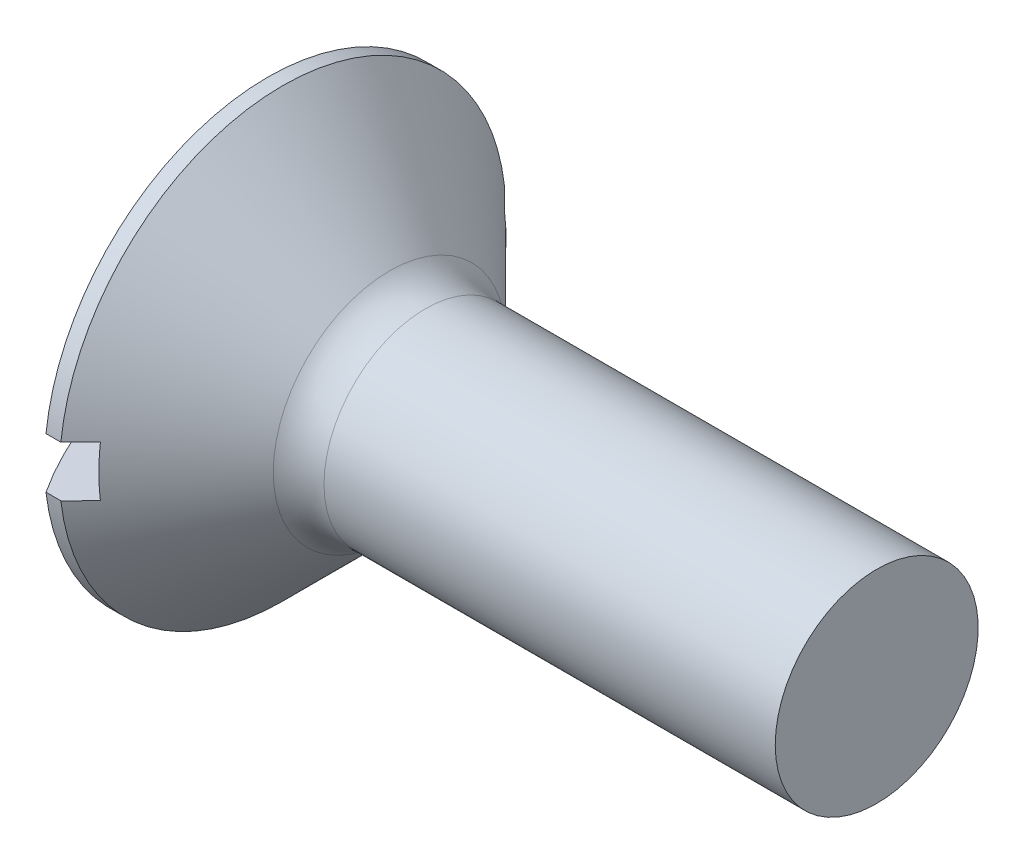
ISO-10303-21;
HEADER;
FILE_DESCRIPTION(('STEP AP214'),'2;1');
FILE_NAME('part.step','',(''),(''),'','','');
FILE_SCHEMA(('AUTOMOTIVE_DESIGN { 1 0 10303 214 1 1 1 1 }'));
ENDSEC;
DATA;
#1=APPLICATION_CONTEXT('core data for automotive mechanical design processes');
#2=APPLICATION_PROTOCOL_DEFINITION('international standard','automotive_design',2000,#1);
#3=PRODUCT_CONTEXT('',#1,'mechanical');
#4=PRODUCT('Part','Part','',(#3));
#5=PRODUCT_RELATED_PRODUCT_CATEGORY('part','',(#4));
#6=PRODUCT_DEFINITION_FORMATION('','',#4);
#7=PRODUCT_DEFINITION_CONTEXT('part definition',#1,'design');
#8=PRODUCT_DEFINITION('design','',#6,#7);
#9=PRODUCT_DEFINITION_SHAPE('','',#8);
#10=(LENGTH_UNIT() NAMED_UNIT(*) SI_UNIT(.MILLI.,.METRE.));
#11=(NAMED_UNIT(*) PLANE_ANGLE_UNIT() SI_UNIT($,.RADIAN.));
#12=(NAMED_UNIT(*) SI_UNIT($,.STERADIAN.) SOLID_ANGLE_UNIT());
#13=UNCERTAINTY_MEASURE_WITH_UNIT(LENGTH_MEASURE(1.E-05),#10,'distance_accuracy_value','');
#14=(GEOMETRIC_REPRESENTATION_CONTEXT(3) GLOBAL_UNCERTAINTY_ASSIGNED_CONTEXT((#13)) GLOBAL_UNIT_ASSIGNED_CONTEXT((#10,
#11,#12)) REPRESENTATION_CONTEXT('',''));
#15=CARTESIAN_POINT('',(0.,0.,0.));
#16=DIRECTION('',(0.,0.,1.));
#17=DIRECTION('',(1.,0.,0.));
#18=AXIS2_PLACEMENT_3D('',#15,#16,#17);
#19=CARTESIAN_POINT('',(-1.34990698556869,0.,0.));
#20=DIRECTION('',(-1.,0.,0.));
#21=DIRECTION('',(0.,0.,1.));
#22=AXIS2_PLACEMENT_3D('',#19,#20,#21);
#23=CYLINDRICAL_SURFACE('',#22,2.2);
#24=CARTESIAN_POINT('',(0.805787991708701,0.,0.));
#25=DIRECTION('',(-1.,0.,0.));
#26=DIRECTION('',(0.,0.,1.));
#27=AXIS2_PLACEMENT_3D('',#24,#25,#26);
#28=CIRCLE('',#27,2.2);
#29=CARTESIAN_POINT('',(0.805787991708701,-0.25,-2.18574929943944));
#30=VERTEX_POINT('',#29);
#31=CARTESIAN_POINT('',(0.805787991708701,-0.25,2.18574929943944));
#32=VERTEX_POINT('',#31);
#33=EDGE_CURVE('E113',#30,#32,#28,.T.);
#34=ORIENTED_EDGE('',*,*,#33,.T.);
#35=DIRECTION('',(-1.,0.,0.));
#36=VECTOR('',#35,1.);
#37=CARTESIAN_POINT('',(-1.34990698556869,-0.25,2.18574929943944));
#38=LINE('',#37,#36);
#39=CARTESIAN_POINT('',(0.659341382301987,-0.25,2.18574929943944));
#40=VERTEX_POINT('',#39);
#41=EDGE_CURVE('E118',#32,#40,#38,.T.);
#42=ORIENTED_EDGE('',*,*,#41,.T.);
#43=CARTESIAN_POINT('',(0.659341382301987,0.,0.));
#44=DIRECTION('',(-1.,0.,0.));
#45=DIRECTION('',(0.,0.,1.));
#46=AXIS2_PLACEMENT_3D('',#43,#44,#45);
#47=CIRCLE('',#46,2.2);
#48=CARTESIAN_POINT('',(0.659341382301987,-0.25,-2.18574929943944));
#49=VERTEX_POINT('',#48);
#50=EDGE_CURVE('E165',#49,#40,#47,.T.);
#51=ORIENTED_EDGE('',*,*,#50,.F.);
#52=DIRECTION('',(-1.,0.,0.));
#53=VECTOR('',#52,1.);
#54=CARTESIAN_POINT('',(-1.34990698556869,-0.25,-2.18574929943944));
#55=LINE('',#54,#53);
#56=EDGE_CURVE('E58',#49,#30,#55,.F.);
#57=ORIENTED_EDGE('',*,*,#56,.T.);
#58=EDGE_LOOP('',(#34,#42,#51,#57));
#59=FACE_BOUND('',#58,.T.);
#60=ADVANCED_FACE('F43',(#59),#23,.T.);
#61=CARTESIAN_POINT('',(4.,0.,0.));
#62=DIRECTION('',(-1.,0.,0.));
#63=DIRECTION('',(0.,1.,0.));
#64=AXIS2_PLACEMENT_3D('',#61,#62,#63);
#65=SPHERICAL_SURFACE('',#64,4.);
#66=CARTESIAN_POINT('',(0.659341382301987,0.25,2.18574929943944));
#67=VERTEX_POINT('',#66);
#68=CARTESIAN_POINT('',(0.659341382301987,0.25,-2.18574929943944));
#69=VERTEX_POINT('',#68);
#70=EDGE_CURVE('E161',#67,#69,#47,.T.);
#71=ORIENTED_EDGE('',*,*,#70,.T.);
#72=CARTESIAN_POINT('',(4.,0.25,0.));
#73=DIRECTION('',(0.,1.,0.));
#74=DIRECTION('',(0.,0.,1.));
#75=AXIS2_PLACEMENT_3D('',#72,#73,#74);
#76=CIRCLE('',#75,3.99217985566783);
#77=EDGE_CURVE('E178',#69,#67,#76,.T.);
#78=ORIENTED_EDGE('',*,*,#77,.T.);
#79=EDGE_LOOP('',(#71,#78));
#80=FACE_BOUND('',#79,.T.);
#81=ADVANCED_FACE('F141',(#80),#65,.T.);
#82=CARTESIAN_POINT('',(6.65934138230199,1.,0.));
#83=DIRECTION('',(-1.,0.,0.));
#84=DIRECTION('',(0.,0.,1.));
#85=AXIS2_PLACEMENT_3D('',#82,#83,#84);
#86=PLANE('',#85);
#87=CARTESIAN_POINT('',(6.65934138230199,0.,0.));
#88=DIRECTION('',(-1.,0.,0.));
#89=DIRECTION('',(0.,0.,1.));
#90=AXIS2_PLACEMENT_3D('',#87,#88,#89);
#91=CIRCLE('',#90,1.);
#92=CARTESIAN_POINT('',(6.65934138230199,0.,1.));
#93=VERTEX_POINT('',#92);
#94=EDGE_CURVE('E174',#93,#93,#91,.T.);
#95=ORIENTED_EDGE('',*,*,#94,.F.);
#96=EDGE_LOOP('',(#95));
#97=FACE_BOUND('',#96,.T.);
#98=ADVANCED_FACE('F45',(#97),#86,.F.);
#99=CARTESIAN_POINT('',(-1.34990698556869,0.,0.));
#100=DIRECTION('',(-1.,0.,0.));
#101=DIRECTION('',(0.,0.,1.));
#102=AXIS2_PLACEMENT_3D('',#99,#100,#101);
#103=CYLINDRICAL_SURFACE('',#102,1.);
#104=CARTESIAN_POINT('',(2.21289477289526,0.,0.));
#105=DIRECTION('',(-1.,0.,0.));
#106=DIRECTION('',(0.,0.,1.));
#107=AXIS2_PLACEMENT_3D('',#104,#105,#106);
#108=CIRCLE('',#107,1.);
#109=CARTESIAN_POINT('',(2.21289477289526,0.,1.));
#110=VERTEX_POINT('',#109);
#111=EDGE_CURVE('E171',#110,#110,#108,.T.);
#112=ORIENTED_EDGE('',*,*,#111,.F.);
#113=EDGE_LOOP('',(#112));
#114=FACE_BOUND('',#113,.T.);
#115=ORIENTED_EDGE('',*,*,#94,.T.);
#116=EDGE_LOOP('',(#115));
#117=FACE_BOUND('',#116,.T.);
#118=ADVANCED_FACE('F242',(#114,#117),#103,.T.);
#119=CARTESIAN_POINT('',(2.21289477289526,0.,0.));
#120=DIRECTION('',(-1.,0.,0.));
#121=DIRECTION('',(0.,0.,1.));
#122=AXIS2_PLACEMENT_3D('',#119,#120,#121);
#123=TOROIDAL_SURFACE('',#122,1.5,0.5);
#124=CARTESIAN_POINT('',(1.85934138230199,0.,0.));
#125=DIRECTION('',(-1.,0.,0.));
#126=DIRECTION('',(0.,0.,1.));
#127=AXIS2_PLACEMENT_3D('',#124,#125,#126);
#128=CIRCLE('',#127,1.14644660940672);
#129=CARTESIAN_POINT('',(1.85934138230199,0.,1.14644660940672));
#130=VERTEX_POINT('',#129);
#131=EDGE_CURVE('E163',#130,#130,#128,.T.);
#132=ORIENTED_EDGE('',*,*,#131,.F.);
#133=EDGE_LOOP('',(#132));
#134=FACE_BOUND('',#133,.T.);
#135=ORIENTED_EDGE('',*,*,#111,.T.);
#136=EDGE_LOOP('',(#135));
#137=FACE_BOUND('',#136,.T.);
#138=ADVANCED_FACE('F148',(#134,#137),#123,.F.);
#139=CARTESIAN_POINT('',(1.85934138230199,0.,0.));
#140=DIRECTION('',(-1.,0.,0.));
#141=DIRECTION('',(0.,0.,1.));
#142=AXIS2_PLACEMENT_3D('',#139,#140,#141);
#143=CONICAL_SURFACE('',#142,1.14644660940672,0.785398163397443);
#144=CARTESIAN_POINT('',(1.,0.,0.));
#145=DIRECTION('',(1.,0.,0.));
#146=DIRECTION('',(0.,0.,-1.));
#147=AXIS2_PLACEMENT_3D('',#144,#145,#146);
#148=CIRCLE('',#147,2.0057879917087);
#149=CARTESIAN_POINT('',(1.,-0.25,-1.99014709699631));
#150=VERTEX_POINT('',#149);
#151=CARTESIAN_POINT('',(1.,0.25,-1.99014709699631));
#152=VERTEX_POINT('',#151);
#153=EDGE_CURVE('E11',#150,#152,#148,.T.);
#154=ORIENTED_EDGE('',*,*,#153,.T.);
#155=CARTESIAN_POINT('',(-1.83698245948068,0.25,4.83631322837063));
#156=CARTESIAN_POINT('',(-1.67200251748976,0.25,4.67111124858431));
#157=CARTESIAN_POINT('',(-1.50703219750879,0.25,4.50589965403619));
#158=CARTESIAN_POINT('',(-1.17712189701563,0.25,4.17544365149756));
#159=CARTESIAN_POINT('',(-1.01218191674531,0.25,4.01019924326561));
#160=CARTESIAN_POINT('',(-0.682317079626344,0.25,3.67963765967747));
#161=CARTESIAN_POINT('',(-0.517392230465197,0.25,3.51432047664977));
#162=CARTESIAN_POINT('',(-0.187610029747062,0.25,3.18362124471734));
#163=CARTESIAN_POINT('',(-0.0227526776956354,0.25,3.0182391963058));
#164=CARTESIAN_POINT('',(0.310957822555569,0.25,2.68324954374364));
#165=CARTESIAN_POINT('',(0.479808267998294,0.25,2.51363924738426));
#166=CARTESIAN_POINT('',(0.817318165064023,0.25,2.17422109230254));
#167=CARTESIAN_POINT('',(0.985977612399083,0.25,2.00441322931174));
#168=CARTESIAN_POINT('',(1.23864723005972,0.25,1.74940368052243));
#169=CARTESIAN_POINT('',(1.32281246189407,0.25,1.66435565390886));
#170=CARTESIAN_POINT('',(1.49097971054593,0.25,1.49409670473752));
#171=CARTESIAN_POINT('',(1.574981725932,0.25,1.40888578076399));
#172=CARTESIAN_POINT('',(1.74270521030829,0.25,1.23819529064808));
#173=CARTESIAN_POINT('',(1.82642669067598,0.25,1.15271573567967));
#174=CARTESIAN_POINT('',(1.99336991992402,0.25,0.981270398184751));
#175=CARTESIAN_POINT('',(2.07659167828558,0.25,0.895304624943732));
#176=CARTESIAN_POINT('',(2.18157923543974,0.25,0.785407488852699));
#177=CARTESIAN_POINT('',(2.20387594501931,0.25,0.761984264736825));
#178=CARTESIAN_POINT('',(2.24835297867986,0.25,0.715027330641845));
#179=CARTESIAN_POINT('',(2.27053330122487,0.25,0.691493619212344));
#180=CARTESIAN_POINT('',(2.33674522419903,0.25,0.620804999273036));
#181=CARTESIAN_POINT('',(2.38056068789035,0.25,0.573445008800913));
#182=CARTESIAN_POINT('',(2.45273508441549,0.25,0.493510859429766));
#183=CARTESIAN_POINT('',(2.48141411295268,0.25,0.461225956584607));
#184=CARTESIAN_POINT('',(2.53801077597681,0.25,0.395724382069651));
#185=CARTESIAN_POINT('',(2.56592437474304,0.25,0.362504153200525));
#186=CARTESIAN_POINT('',(2.60656438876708,0.25,0.311422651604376));
#187=CARTESIAN_POINT('',(2.61996632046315,0.25,0.294102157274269));
#188=CARTESIAN_POINT('',(2.6460562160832,0.25,0.258934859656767));
#189=CARTESIAN_POINT('',(2.65874444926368,0.25,0.241088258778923));
#190=CARTESIAN_POINT('',(2.68293598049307,0.25,0.204736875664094));
#191=CARTESIAN_POINT('',(2.69444527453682,0.25,0.186236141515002));
#192=CARTESIAN_POINT('',(2.71558726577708,0.25,0.148210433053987));
#193=CARTESIAN_POINT('',(2.7252251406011,0.25,0.128688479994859));
#194=CARTESIAN_POINT('',(2.7393019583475,0.25,0.0933128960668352));
#195=CARTESIAN_POINT('',(2.74443725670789,0.25,0.0777471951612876));
#196=CARTESIAN_POINT('',(2.75204947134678,0.25,0.0460145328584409));
#197=CARTESIAN_POINT('',(2.75453865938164,0.25,0.029850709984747));
#198=CARTESIAN_POINT('',(2.75630624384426,0.25,-0.00280238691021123));
#199=CARTESIAN_POINT('',(2.75555754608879,0.25,-0.0192932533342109));
#200=CARTESIAN_POINT('',(2.75098042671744,0.25,-0.0518644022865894));
#201=CARTESIAN_POINT('',(2.74714133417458,0.25,-0.06794306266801));
#202=CARTESIAN_POINT('',(2.73445798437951,0.25,-0.107972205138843));
#203=CARTESIAN_POINT('',(2.72402277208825,0.25,-0.131395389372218));
#204=CARTESIAN_POINT('',(2.70620549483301,0.25,-0.165353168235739));
#205=CARTESIAN_POINT('',(2.69988385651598,0.25,-0.176507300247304));
#206=CARTESIAN_POINT('',(2.68669482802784,0.25,-0.198488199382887));
#207=CARTESIAN_POINT('',(2.67982767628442,0.25,-0.209315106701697));
#208=CARTESIAN_POINT('',(2.65584214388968,0.25,-0.245635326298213));
#209=CARTESIAN_POINT('',(2.63779409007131,0.25,-0.270506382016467));
#210=CARTESIAN_POINT('',(2.60051835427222,0.25,-0.319355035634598));
#211=CARTESIAN_POINT('',(2.58128966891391,0.25,-0.343331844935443));
#212=CARTESIAN_POINT('',(2.54209197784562,0.25,-0.390758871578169));
#213=CARTESIAN_POINT('',(2.52212144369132,0.25,-0.414207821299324));
#214=CARTESIAN_POINT('',(2.4817349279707,0.25,-0.460720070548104));
#215=CARTESIAN_POINT('',(2.4613189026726,0.25,-0.483783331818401));
#216=CARTESIAN_POINT('',(2.39956443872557,0.25,-0.552654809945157));
#217=CARTESIAN_POINT('',(2.35778563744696,0.25,-0.598067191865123));
#218=CARTESIAN_POINT('',(2.27369736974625,0.25,-0.688267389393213));
#219=CARTESIAN_POINT('',(2.2313887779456,0.25,-0.733056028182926));
#220=CARTESIAN_POINT('',(2.10469544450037,0.25,-0.866154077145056));
#221=CARTESIAN_POINT('',(2.01981164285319,0.25,-0.953987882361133));
#222=CARTESIAN_POINT('',(1.84949069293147,0.25,-1.12911950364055));
#223=CARTESIAN_POINT('',(1.76405352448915,0.25,-1.21641729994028));
#224=CARTESIAN_POINT('',(1.59282418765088,0.25,-1.39076948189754));
#225=CARTESIAN_POINT('',(1.50703183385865,0.25,-1.47782368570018));
#226=CARTESIAN_POINT('',(1.33527318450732,0.25,-1.651757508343));
#227=CARTESIAN_POINT('',(1.24930689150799,0.25,-1.73863712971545));
#228=CARTESIAN_POINT('',(0.991738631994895,0.25,-1.99861440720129));
#229=CARTESIAN_POINT('',(0.819973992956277,0.25,-2.17155089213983));
#230=CARTESIAN_POINT('',(0.476274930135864,0.25,-2.51719193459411));
#231=CARTESIAN_POINT('',(0.304340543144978,0.25,-2.68989652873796));
#232=CARTESIAN_POINT('',(-0.0314189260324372,0.25,-3.02693427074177));
#233=CARTESIAN_POINT('',(-0.195238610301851,0.25,-3.19127279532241));
#234=CARTESIAN_POINT('',(-0.522952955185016,0.25,-3.51989485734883));
#235=CARTESIAN_POINT('',(-0.686847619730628,0.25,-3.6841783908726));
#236=CARTESIAN_POINT('',(-1.01510328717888,0.25,-4.01312614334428));
#237=CARTESIAN_POINT('',(-1.1794644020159,0.25,-4.17779025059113));
#238=CARTESIAN_POINT('',(-1.50820797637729,0.25,-4.50707716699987));
#239=CARTESIAN_POINT('',(-1.67259043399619,0.25,-4.67169997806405));
#240=CARTESIAN_POINT('',(-1.83698245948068,0.25,-4.83631322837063));
#241=B_SPLINE_CURVE_WITH_KNOTS('',3,(#155,#156,#157,#158,#159,#160,#161,#162,#163,#164,#165,
#166,#167,#168,#169,#170,#171,#172,#173,#174,#175,#176,#177,#178,#179,#180,#181,#182,#183,#184,
#185,#186,#187,#188,#189,#190,#191,#192,#193,#194,#195,#196,#197,#198,#199,#200,#201,#202,#203,
#204,#205,#206,#207,#208,#209,#210,#211,#212,#213,#214,#215,#216,#217,#218,#219,#220,#221,#222,
#223,#224,#225,#226,#227,#228,#229,#230,#231,#232,#233,#234,#235,#236,#237,#238,#239,#240),
.UNSPECIFIED.,.F.,.F.,(4,2,2,2,2,2,2,2,2,2,2,2,2,2,2,2,2,2,2,2,2,2,2,2,2,2,2,2,2,2,2,2,2,2,2,2,
2,2,2,2,2,2,4),(0.,0.70042179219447,1.40084894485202,2.1013985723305,2.80194297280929,
3.51992841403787,4.23792966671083,4.59688999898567,4.95585346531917,5.31480219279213,
5.67374408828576,5.77075967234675,5.86777653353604,6.06132118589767,6.19086619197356,
6.32099779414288,6.38668698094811,6.45235121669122,6.5176629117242,6.5827912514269,
6.63180034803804,6.68058115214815,6.72977093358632,6.779131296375,6.85560463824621,
6.894068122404,6.93251488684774,7.02462569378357,7.11681589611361,7.20920790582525,
7.3016090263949,7.48671665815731,7.67155097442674,8.03798504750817,8.4044325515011,
8.77110452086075,9.13777113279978,9.86899633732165,10.6000878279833,11.2962173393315,
11.9923889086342,12.6903570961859,13.3882828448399),.UNSPECIFIED.);
#242=CARTESIAN_POINT('',(0.805787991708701,0.25,-2.18574929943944));
#243=VERTEX_POINT('',#242);
#244=EDGE_CURVE('E184',#152,#243,#241,.T.);
#245=ORIENTED_EDGE('',*,*,#244,.T.);
#246=CARTESIAN_POINT('',(0.805787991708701,0.25,2.18574929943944));
#247=VERTEX_POINT('',#246);
#248=EDGE_CURVE('E160',#247,#243,#28,.T.);
#249=ORIENTED_EDGE('',*,*,#248,.F.);
#250=CARTESIAN_POINT('',(1.,0.25,1.99014709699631));
#251=VERTEX_POINT('',#250);
#252=EDGE_CURVE('E183',#247,#251,#241,.T.);
#253=ORIENTED_EDGE('',*,*,#252,.T.);
#254=CARTESIAN_POINT('',(1.,-0.25,1.99014709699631));
#255=VERTEX_POINT('',#254);
#256=EDGE_CURVE('E47',#251,#255,#148,.T.);
#257=ORIENTED_EDGE('',*,*,#256,.T.);
#258=CARTESIAN_POINT('',(-1.83698245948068,-0.25,-4.83631322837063));
#259=CARTESIAN_POINT('',(-1.67200251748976,-0.25,-4.67111124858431));
#260=CARTESIAN_POINT('',(-1.50703219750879,-0.25,-4.50589965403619));
#261=CARTESIAN_POINT('',(-1.17712189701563,-0.25,-4.17544365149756));
#262=CARTESIAN_POINT('',(-1.01218191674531,-0.25,-4.01019924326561));
#263=CARTESIAN_POINT('',(-0.682317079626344,-0.25,-3.67963765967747));
#264=CARTESIAN_POINT('',(-0.517392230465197,-0.25,-3.51432047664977));
#265=CARTESIAN_POINT('',(-0.187610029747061,-0.25,-3.18362124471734));
#266=CARTESIAN_POINT('',(-0.0227526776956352,-0.25,-3.0182391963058));
#267=CARTESIAN_POINT('',(0.310957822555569,-0.25,-2.68324954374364));
#268=CARTESIAN_POINT('',(0.479808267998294,-0.25,-2.51363924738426));
#269=CARTESIAN_POINT('',(0.817318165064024,-0.25,-2.17422109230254));
#270=CARTESIAN_POINT('',(0.985977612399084,-0.25,-2.00441322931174));
#271=CARTESIAN_POINT('',(1.23864723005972,-0.25,-1.74940368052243));
#272=CARTESIAN_POINT('',(1.32281246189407,-0.25,-1.66435565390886));
#273=CARTESIAN_POINT('',(1.49097971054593,-0.25,-1.49409670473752));
#274=CARTESIAN_POINT('',(1.574981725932,-0.25,-1.40888578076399));
#275=CARTESIAN_POINT('',(1.74270521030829,-0.25,-1.23819529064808));
#276=CARTESIAN_POINT('',(1.82642669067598,-0.25,-1.15271573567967));
#277=CARTESIAN_POINT('',(1.99336991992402,-0.25,-0.981270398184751));
#278=CARTESIAN_POINT('',(2.07659167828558,-0.25,-0.895304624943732));
#279=CARTESIAN_POINT('',(2.18157923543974,-0.25,-0.785407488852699));
#280=CARTESIAN_POINT('',(2.20387594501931,-0.25,-0.761984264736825));
#281=CARTESIAN_POINT('',(2.24835297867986,-0.25,-0.715027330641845));
#282=CARTESIAN_POINT('',(2.27053330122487,-0.25,-0.691493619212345));
#283=CARTESIAN_POINT('',(2.33674522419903,-0.25,-0.620804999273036));
#284=CARTESIAN_POINT('',(2.38056068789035,-0.25,-0.573445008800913));
#285=CARTESIAN_POINT('',(2.45273508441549,-0.25,-0.493510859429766));
#286=CARTESIAN_POINT('',(2.48141411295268,-0.25,-0.461225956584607));
#287=CARTESIAN_POINT('',(2.53801077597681,-0.25,-0.395724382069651));
#288=CARTESIAN_POINT('',(2.56592437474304,-0.25,-0.362504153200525));
#289=CARTESIAN_POINT('',(2.60656438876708,-0.25,-0.311422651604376));
#290=CARTESIAN_POINT('',(2.61996632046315,-0.25,-0.294102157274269));
#291=CARTESIAN_POINT('',(2.6460562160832,-0.25,-0.258934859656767));
#292=CARTESIAN_POINT('',(2.65874444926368,-0.25,-0.241088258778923));
#293=CARTESIAN_POINT('',(2.68293598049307,-0.25,-0.204736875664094));
#294=CARTESIAN_POINT('',(2.69444527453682,-0.25,-0.186236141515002));
#295=CARTESIAN_POINT('',(2.71558726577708,-0.25,-0.148210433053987));
#296=CARTESIAN_POINT('',(2.7252251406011,-0.25,-0.128688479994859));
#297=CARTESIAN_POINT('',(2.7393019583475,-0.25,-0.0933128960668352));
#298=CARTESIAN_POINT('',(2.74443725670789,-0.25,-0.0777471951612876));
#299=CARTESIAN_POINT('',(2.75204947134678,-0.25,-0.0460145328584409));
#300=CARTESIAN_POINT('',(2.75453865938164,-0.25,-0.029850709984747));
#301=CARTESIAN_POINT('',(2.75630624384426,-0.25,0.00280238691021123));
#302=CARTESIAN_POINT('',(2.75555754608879,-0.25,0.0192932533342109));
#303=CARTESIAN_POINT('',(2.75098042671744,-0.25,0.0518644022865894));
#304=CARTESIAN_POINT('',(2.74714133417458,-0.25,0.06794306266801));
#305=CARTESIAN_POINT('',(2.73445798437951,-0.25,0.107972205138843));
#306=CARTESIAN_POINT('',(2.72402277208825,-0.25,0.131395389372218));
#307=CARTESIAN_POINT('',(2.70620549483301,-0.25,0.165353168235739));
#308=CARTESIAN_POINT('',(2.69988385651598,-0.25,0.176507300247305));
#309=CARTESIAN_POINT('',(2.68669482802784,-0.25,0.198488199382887));
#310=CARTESIAN_POINT('',(2.67982767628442,-0.25,0.209315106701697));
#311=CARTESIAN_POINT('',(2.65584214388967,-0.25,0.245635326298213));
#312=CARTESIAN_POINT('',(2.63779409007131,-0.25,0.270506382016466));
#313=CARTESIAN_POINT('',(2.60051835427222,-0.25,0.319355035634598));
#314=CARTESIAN_POINT('',(2.58128966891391,-0.25,0.343331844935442));
#315=CARTESIAN_POINT('',(2.54209197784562,-0.25,0.390758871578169));
#316=CARTESIAN_POINT('',(2.52212144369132,-0.25,0.414207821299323));
#317=CARTESIAN_POINT('',(2.4817349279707,-0.25,0.460720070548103));
#318=CARTESIAN_POINT('',(2.4613189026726,-0.25,0.483783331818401));
#319=CARTESIAN_POINT('',(2.39956443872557,-0.25,0.552654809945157));
#320=CARTESIAN_POINT('',(2.35778563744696,-0.25,0.598067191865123));
#321=CARTESIAN_POINT('',(2.27369736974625,-0.25,0.688267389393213));
#322=CARTESIAN_POINT('',(2.2313887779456,-0.25,0.733056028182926));
#323=CARTESIAN_POINT('',(2.10469544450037,-0.25,0.866154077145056));
#324=CARTESIAN_POINT('',(2.01981164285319,-0.25,0.953987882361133));
#325=CARTESIAN_POINT('',(1.84949069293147,-0.25,1.12911950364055));
#326=CARTESIAN_POINT('',(1.76405352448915,-0.25,1.21641729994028));
#327=CARTESIAN_POINT('',(1.59282418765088,-0.25,1.39076948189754));
#328=CARTESIAN_POINT('',(1.50703183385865,-0.25,1.47782368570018));
#329=CARTESIAN_POINT('',(1.33527318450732,-0.25,1.651757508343));
#330=CARTESIAN_POINT('',(1.24930689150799,-0.25,1.73863712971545));
#331=CARTESIAN_POINT('',(0.991738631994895,-0.25,1.99861440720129));
#332=CARTESIAN_POINT('',(0.819973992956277,-0.25,2.17155089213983));
#333=CARTESIAN_POINT('',(0.476274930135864,-0.25,2.51719193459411));
#334=CARTESIAN_POINT('',(0.304340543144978,-0.25,2.68989652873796));
#335=CARTESIAN_POINT('',(-0.0314189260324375,-0.25,3.02693427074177));
#336=CARTESIAN_POINT('',(-0.195238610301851,-0.25,3.19127279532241));
#337=CARTESIAN_POINT('',(-0.522952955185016,-0.25,3.51989485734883));
#338=CARTESIAN_POINT('',(-0.686847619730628,-0.25,3.6841783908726));
#339=CARTESIAN_POINT('',(-1.01510328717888,-0.25,4.01312614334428));
#340=CARTESIAN_POINT('',(-1.1794644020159,-0.25,4.17779025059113));
#341=CARTESIAN_POINT('',(-1.5082079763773,-0.25,4.50707716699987));
#342=CARTESIAN_POINT('',(-1.67259043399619,-0.25,4.67169997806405));
#343=CARTESIAN_POINT('',(-1.83698245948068,-0.25,4.83631322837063));
#344=B_SPLINE_CURVE_WITH_KNOTS('',3,(#258,#259,#260,#261,#262,#263,#264,#265,#266,#267,#268,
#269,#270,#271,#272,#273,#274,#275,#276,#277,#278,#279,#280,#281,#282,#283,#284,#285,#286,#287,
#288,#289,#290,#291,#292,#293,#294,#295,#296,#297,#298,#299,#300,#301,#302,#303,#304,#305,#306,
#307,#308,#309,#310,#311,#312,#313,#314,#315,#316,#317,#318,#319,#320,#321,#322,#323,#324,#325,
#326,#327,#328,#329,#330,#331,#332,#333,#334,#335,#336,#337,#338,#339,#340,#341,#342,#343),
.UNSPECIFIED.,.F.,.F.,(4,2,2,2,2,2,2,2,2,2,2,2,2,2,2,2,2,2,2,2,2,2,2,2,2,2,2,2,2,2,2,2,2,2,2,2,
2,2,2,2,2,2,4),(0.,0.700421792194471,1.40084894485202,2.1013985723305,2.80194297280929,
3.51992841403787,4.23792966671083,4.59688999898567,4.95585346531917,5.31480219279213,
5.67374408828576,5.77075967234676,5.86777653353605,6.06132118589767,6.19086619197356,
6.32099779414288,6.38668698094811,6.45235121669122,6.5176629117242,6.58279125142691,
6.63180034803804,6.68058115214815,6.72977093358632,6.779131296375,6.85560463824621,
6.89406812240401,6.93251488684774,7.02462569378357,7.11681589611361,7.20920790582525,
7.30160902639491,7.48671665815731,7.67155097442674,8.03798504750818,8.40443255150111,
8.77110452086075,9.13777113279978,9.86899633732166,10.6000878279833,11.2962173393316,
11.9923889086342,12.6903570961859,13.3882828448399),.UNSPECIFIED.);
#345=EDGE_CURVE('E107',#255,#32,#344,.T.);
#346=ORIENTED_EDGE('',*,*,#345,.T.);
#347=ORIENTED_EDGE('',*,*,#33,.F.);
#348=EDGE_CURVE('E105',#30,#150,#344,.T.);
#349=ORIENTED_EDGE('',*,*,#348,.T.);
#350=EDGE_LOOP('',(#154,#245,#249,#253,#257,#346,#347,#349));
#351=FACE_BOUND('',#350,.T.);
#352=ORIENTED_EDGE('',*,*,#131,.T.);
#353=EDGE_LOOP('',(#352));
#354=FACE_BOUND('',#353,.T.);
#355=ADVANCED_FACE('F110',(#351,#354),#143,.T.);
#356=ORIENTED_EDGE('',*,*,#248,.T.);
#357=DIRECTION('',(-1.,0.,0.));
#358=VECTOR('',#357,1.);
#359=CARTESIAN_POINT('',(-1.34990698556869,0.25,-2.18574929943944));
#360=LINE('',#359,#358);
#361=EDGE_CURVE('E66',#243,#69,#360,.T.);
#362=ORIENTED_EDGE('',*,*,#361,.T.);
#363=ORIENTED_EDGE('',*,*,#70,.F.);
#364=DIRECTION('',(-1.,0.,0.));
#365=VECTOR('',#364,1.);
#366=CARTESIAN_POINT('',(-1.34990698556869,0.25,2.18574929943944));
#367=LINE('',#366,#365);
#368=EDGE_CURVE('E114',#67,#247,#367,.F.);
#369=ORIENTED_EDGE('',*,*,#368,.T.);
#370=EDGE_LOOP('',(#356,#362,#363,#369));
#371=FACE_BOUND('',#370,.T.);
#372=ADVANCED_FACE('F139',(#371),#23,.T.);
#373=ORIENTED_EDGE('',*,*,#50,.T.);
#374=CARTESIAN_POINT('',(4.,-0.25,0.));
#375=DIRECTION('',(0.,-1.,0.));
#376=DIRECTION('',(0.,0.,-1.));
#377=AXIS2_PLACEMENT_3D('',#374,#375,#376);
#378=CIRCLE('',#377,3.99217985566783);
#379=EDGE_CURVE('E177',#40,#49,#378,.T.);
#380=ORIENTED_EDGE('',*,*,#379,.T.);
#381=EDGE_LOOP('',(#373,#380));
#382=FACE_BOUND('',#381,.T.);
#383=ADVANCED_FACE('F137',(#382),#65,.T.);
#384=CARTESIAN_POINT('',(1.,-0.25,-2.2));
#385=DIRECTION('',(1.,0.,0.));
#386=DIRECTION('',(0.,0.,-1.));
#387=AXIS2_PLACEMENT_3D('',#384,#385,#386);
#388=PLANE('',#387);
#389=DIRECTION('',(0.,0.,1.));
#390=VECTOR('',#389,1.);
#391=CARTESIAN_POINT('',(1.,0.25,-2.2));
#392=LINE('',#391,#390);
#393=EDGE_CURVE('E101',#152,#251,#392,.T.);
#394=ORIENTED_EDGE('',*,*,#393,.F.);
#395=ORIENTED_EDGE('',*,*,#153,.F.);
#396=DIRECTION('',(0.,0.,1.));
#397=VECTOR('',#396,1.);
#398=CARTESIAN_POINT('',(1.,-0.25,-2.2));
#399=LINE('',#398,#397);
#400=EDGE_CURVE('E98',#150,#255,#399,.T.);
#401=ORIENTED_EDGE('',*,*,#400,.T.);
#402=ORIENTED_EDGE('',*,*,#256,.F.);
#403=EDGE_LOOP('',(#394,#395,#401,#402));
#404=FACE_BOUND('',#403,.T.);
#405=ADVANCED_FACE('F97',(#404),#388,.F.);
#406=CARTESIAN_POINT('',(0.,0.25,-2.2));
#407=DIRECTION('',(0.,1.,0.));
#408=DIRECTION('',(0.,0.,1.));
#409=AXIS2_PLACEMENT_3D('',#406,#407,#408);
#410=PLANE('',#409);
#411=ORIENTED_EDGE('',*,*,#368,.F.);
#412=ORIENTED_EDGE('',*,*,#77,.F.);
#413=ORIENTED_EDGE('',*,*,#361,.F.);
#414=ORIENTED_EDGE('',*,*,#244,.F.);
#415=ORIENTED_EDGE('',*,*,#393,.T.);
#416=ORIENTED_EDGE('',*,*,#252,.F.);
#417=EDGE_LOOP('',(#411,#412,#413,#414,#415,#416));
#418=FACE_BOUND('',#417,.T.);
#419=ADVANCED_FACE('F135',(#418),#410,.F.);
#420=CARTESIAN_POINT('',(0.,-0.25,-2.2));
#421=DIRECTION('',(0.,-1.,0.));
#422=DIRECTION('',(0.,0.,-1.));
#423=AXIS2_PLACEMENT_3D('',#420,#421,#422);
#424=PLANE('',#423);
#425=ORIENTED_EDGE('',*,*,#56,.F.);
#426=ORIENTED_EDGE('',*,*,#379,.F.);
#427=ORIENTED_EDGE('',*,*,#41,.F.);
#428=ORIENTED_EDGE('',*,*,#345,.F.);
#429=ORIENTED_EDGE('',*,*,#400,.F.);
#430=ORIENTED_EDGE('',*,*,#348,.F.);
#431=EDGE_LOOP('',(#425,#426,#427,#428,#429,#430));
#432=FACE_BOUND('',#431,.T.);
#433=ADVANCED_FACE('F104',(#432),#424,.F.);
#434=CLOSED_SHELL('',(#60,#81,#98,#118,#138,#355,#372,#383,#405,#419,#433));
#435=MANIFOLD_SOLID_BREP('B2',#434);
#436=ADVANCED_BREP_SHAPE_REPRESENTATION('',(#18,#435),#14);
#437=SHAPE_DEFINITION_REPRESENTATION(#9,#436);
ENDSEC;
END-ISO-10303-21;
